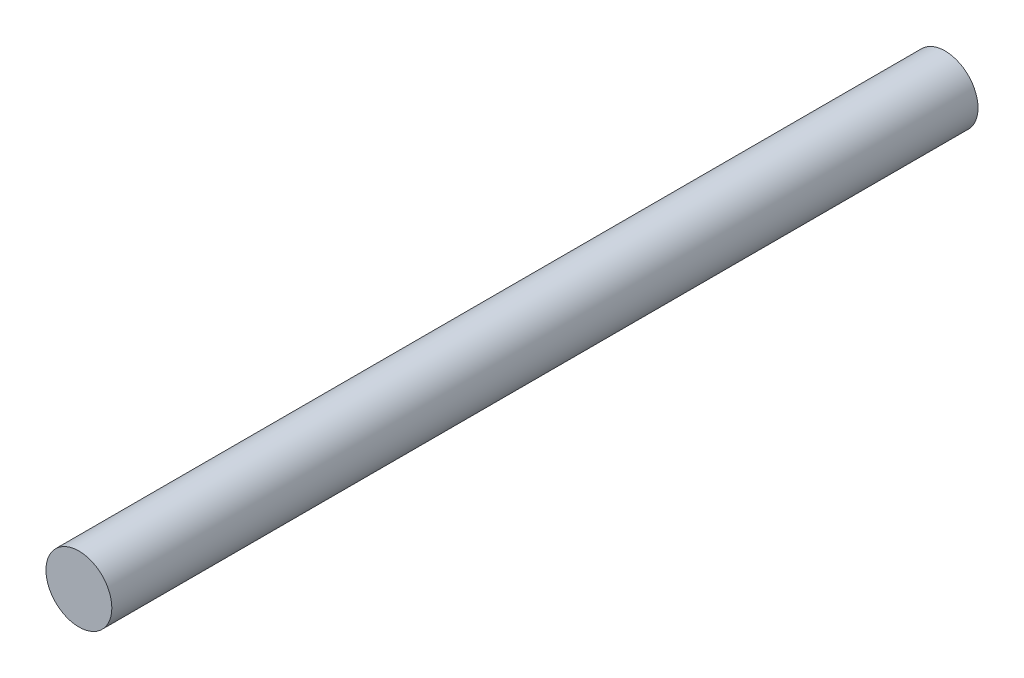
ISO-10303-21;
HEADER;
FILE_DESCRIPTION(('STEP AP214'),'2;1');
FILE_NAME('part.step','',(''),(''),'','','');
FILE_SCHEMA(('AUTOMOTIVE_DESIGN { 1 0 10303 214 1 1 1 1 }'));
ENDSEC;
DATA;
#1=APPLICATION_CONTEXT('core data for automotive mechanical design processes');
#2=APPLICATION_PROTOCOL_DEFINITION('international standard','automotive_design',2000,#1);
#3=PRODUCT_CONTEXT('',#1,'mechanical');
#4=PRODUCT('Part','Part','',(#3));
#5=PRODUCT_RELATED_PRODUCT_CATEGORY('part','',(#4));
#6=PRODUCT_DEFINITION_FORMATION('','',#4);
#7=PRODUCT_DEFINITION_CONTEXT('part definition',#1,'design');
#8=PRODUCT_DEFINITION('design','',#6,#7);
#9=PRODUCT_DEFINITION_SHAPE('','',#8);
#10=(LENGTH_UNIT() NAMED_UNIT(*) SI_UNIT(.MILLI.,.METRE.));
#11=(NAMED_UNIT(*) PLANE_ANGLE_UNIT() SI_UNIT($,.RADIAN.));
#12=(NAMED_UNIT(*) SI_UNIT($,.STERADIAN.) SOLID_ANGLE_UNIT());
#13=UNCERTAINTY_MEASURE_WITH_UNIT(LENGTH_MEASURE(1.E-05),#10,'distance_accuracy_value','');
#14=(GEOMETRIC_REPRESENTATION_CONTEXT(3) GLOBAL_UNCERTAINTY_ASSIGNED_CONTEXT((#13)) GLOBAL_UNIT_ASSIGNED_CONTEXT((#10,
#11,#12)) REPRESENTATION_CONTEXT('',''));
#15=CARTESIAN_POINT('',(0.,0.,0.));
#16=DIRECTION('',(0.,0.,1.));
#17=DIRECTION('',(1.,0.,0.));
#18=AXIS2_PLACEMENT_3D('',#15,#16,#17);
#19=CARTESIAN_POINT('',(0.,0.,460.));
#20=DIRECTION('',(0.,0.,-1.));
#21=DIRECTION('',(-1.,0.,0.));
#22=AXIS2_PLACEMENT_3D('',#19,#20,#21);
#23=CYLINDRICAL_SURFACE('',#22,35.);
#24=CARTESIAN_POINT('',(0.,0.,460.));
#25=DIRECTION('',(0.,0.,1.));
#26=DIRECTION('',(1.,0.,0.));
#27=AXIS2_PLACEMENT_3D('',#24,#25,#26);
#28=CIRCLE('',#27,35.);
#29=CARTESIAN_POINT('',(35.0000000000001,0.,460.));
#30=VERTEX_POINT('',#29);
#31=EDGE_CURVE('E10',#30,#30,#28,.T.);
#32=ORIENTED_EDGE('',*,*,#31,.F.);
#33=EDGE_LOOP('',(#32));
#34=FACE_BOUND('',#33,.T.);
#35=CARTESIAN_POINT('',(0.,0.,-460.));
#36=DIRECTION('',(0.,0.,1.));
#37=DIRECTION('',(1.,0.,0.));
#38=AXIS2_PLACEMENT_3D('',#35,#36,#37);
#39=CIRCLE('',#38,35.);
#40=CARTESIAN_POINT('',(35.0000000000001,0.,-460.));
#41=VERTEX_POINT('',#40);
#42=EDGE_CURVE('E33',#41,#41,#39,.T.);
#43=ORIENTED_EDGE('',*,*,#42,.T.);
#44=EDGE_LOOP('',(#43));
#45=FACE_BOUND('',#44,.T.);
#46=ADVANCED_FACE('F30',(#34,#45),#23,.T.);
#47=CARTESIAN_POINT('',(0.,0.,460.));
#48=DIRECTION('',(0.,0.,1.));
#49=DIRECTION('',(1.,0.,0.));
#50=AXIS2_PLACEMENT_3D('',#47,#48,#49);
#51=PLANE('',#50);
#52=ORIENTED_EDGE('',*,*,#31,.T.);
#53=EDGE_LOOP('',(#52));
#54=FACE_BOUND('',#53,.T.);
#55=ADVANCED_FACE('F45',(#54),#51,.T.);
#56=CARTESIAN_POINT('',(0.,0.,-460.));
#57=DIRECTION('',(0.,0.,1.));
#58=DIRECTION('',(1.,0.,0.));
#59=AXIS2_PLACEMENT_3D('',#56,#57,#58);
#60=PLANE('',#59);
#61=ORIENTED_EDGE('',*,*,#42,.F.);
#62=EDGE_LOOP('',(#61));
#63=FACE_BOUND('',#62,.T.);
#64=ADVANCED_FACE('F43',(#63),#60,.F.);
#65=CLOSED_SHELL('',(#46,#55,#64));
#66=MANIFOLD_SOLID_BREP('B2',#65);
#67=ADVANCED_BREP_SHAPE_REPRESENTATION('',(#18,#66),#14);
#68=SHAPE_DEFINITION_REPRESENTATION(#9,#67);
ENDSEC;
END-ISO-10303-21;
